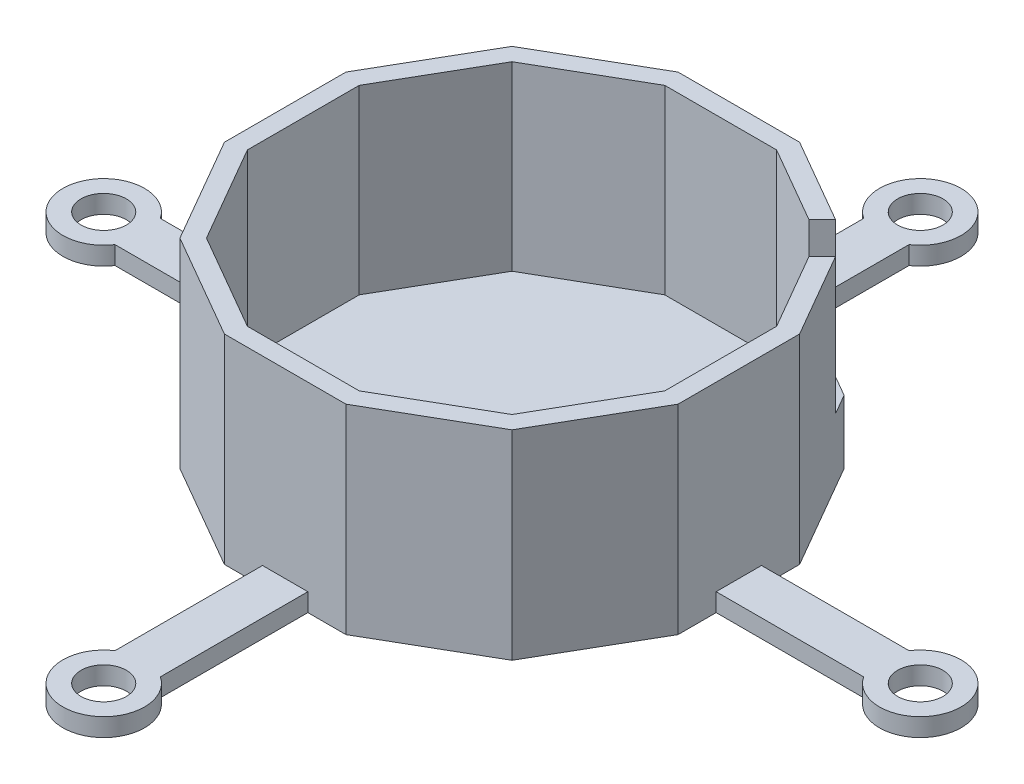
from build123d import *

# Parameters (mm, degrees)
SENSOR_BLOCK_DEPTH    = 22
SKETCH7_W             = 25.275357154
SKETCH7_H             = 13.397459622
SKETCH7_W_2           = 13.397459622
SKETCH7_H_2           = 26.758274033
SKETCH7_W_3           = 26.390122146
SKETCH7_H_3           = 25.961948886
SENSOR_BASE_CUT_DEPTH = 20
WIRE_SLOT_DEPTH       = 15
SKETCH8_R             = 2.5
MOUNT_HOLES_DEPTH     = 2


with BuildPart() as part:
    # Sketch5 → Sensor Block (new body)
    with BuildSketch(Plane(origin=(0, 0, 0), x_dir=(1, 0, 0), z_dir=(0, 1, 0))):
        with BuildLine():
            Line((25, 6.698729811), (18.301270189, 18.301270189))
            Line((18.301270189, 18.301270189), (6.698729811, 25))
            Line((6.698729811, 25), (2.5, 25))
            Line((2.5, 25), (2.5, 41.258342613))
            ThreePointArc((2.5, 41.258342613), (0, 49.5), (-2.5, 41.258342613))
            Line((-2.5, 41.258342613), (-2.5, 25))
            Line((-2.5, 25), (-6.698729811, 25))
            Line((-6.698729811, 25), (-18.301270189, 18.301270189))
            Line((-18.301270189, 18.301270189), (-25, 6.698729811))
            Line((-25, 6.698729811), (-25, 2.5))
            Line((-25, 2.5), (-41.258342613, 2.5))
            ThreePointArc((-41.258342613, 2.5), (-49.5, 0), (-41.258342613, -2.5))
            Line((-41.258342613, -2.5), (-25, -2.5))
            Line((-25, -2.5), (-25, -6.698729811))
            Line((-25, -6.698729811), (-18.301270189, -18.301270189))
            Line((-18.301270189, -18.301270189), (-6.698729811, -25))
            Line((-6.698729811, -25), (-2.5, -25))
            Line((-2.5, -25), (-2.5, -41.258342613))
            ThreePointArc((-2.5, -41.258342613), (0, -49.5), (2.5, -41.258342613))
            Line((2.5, -41.258342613), (2.5, -25))
            Line((2.5, -25), (6.698729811, -25))
            Line((6.698729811, -25), (18.301270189, -18.301270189))
            Line((18.301270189, -18.301270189), (25, -6.698729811))
            Line((25, -6.698729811), (25, -2.5))
            Line((25, -2.5), (41.258342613, -2.5))
            ThreePointArc((41.258342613, -2.5), (49.5, 0), (41.258342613, 2.5))
            Line((41.258342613, 2.5), (25, 2.5))
            Line((25, 2.5), (25, 6.698729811))
        make_face()
    extrude(amount=SENSOR_BLOCK_DEPTH)

    # Sketch7 → Sensor Base Cut (cut)
    with BuildSketch(Plane(origin=(0, 22, 0), x_dir=(1, 0, 0), z_dir=(0, 1, 0))):
        with Locations((37.637678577, 0)):
            Rectangle(SKETCH7_W, SKETCH7_H)
        Polygon((23, 6.162831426), (16.837168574, 16.837168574), (6.162831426, 23), (-6.162831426, 23), (-16.837168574, 16.837168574), (-23, 6.162831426), (-23, -6.162831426), (-16.837168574, -16.837168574), (-6.162831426, -23), (6.162831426, -23), (16.837168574, -16.837168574), (23, -6.162831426), align=None)
        with Locations((0, 38.379137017)):
            Rectangle(SKETCH7_W_2, SKETCH7_H_2)
        with Locations((-38.195061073, 0)):
            Rectangle(SKETCH7_W_3, SKETCH7_H)
        with Locations((0, -37.980974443)):
            Rectangle(SKETCH7_W_2, SKETCH7_H_3)
    extrude(amount=-SENSOR_BASE_CUT_DEPTH, mode=Mode.SUBTRACT)

    # Sketch3 → Wire Slot (cut)
    with BuildSketch(Plane(origin=(0, 22, 0), x_dir=(1, 0, 0), z_dir=(0, 1, 0))):
        Polygon((17.939771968, 14.404238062), (20.745533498, 17.209999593), (17.209999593, 20.745533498), (14.381572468, 17.917106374), align=None)
    extrude(amount=-WIRE_SLOT_DEPTH, mode=Mode.SUBTRACT)

    # Sketch8 → Mount Holes (cut)
    with BuildSketch(Plane(origin=(0, 0, 0), x_dir=(1, 0, 0), z_dir=(0, 1, 0))):
        with Locations(Location((45, 0, 0), (0, 0, 270))):
            Circle(SKETCH8_R)
        with Locations(Location((0, 45, 0), (0, 0, 270))):
            Circle(SKETCH8_R)
        with Locations(Location((0, -45, 0), (0, 0, 270))):
            Circle(SKETCH8_R)
        with Locations(Location((-45, 0, 0), (0, 0, 270))):
            Circle(SKETCH8_R)
    extrude(amount=MOUNT_HOLES_DEPTH, mode=Mode.SUBTRACT)


solid = part.part
